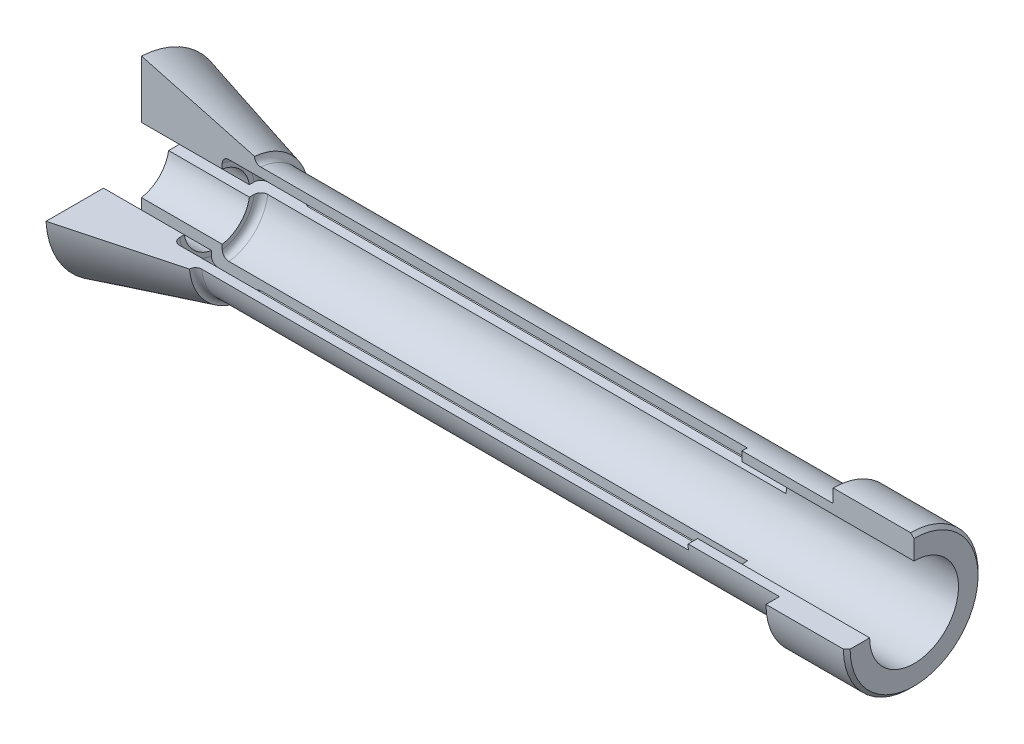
from build123d import *

# Parameters (mm, degrees)
CHANFREIN1_SIZE         = 0.25
ENL_V_MAT_EXTRU_1_DEPTH = 45
COUPE_DEPTH             = 59.549025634


with BuildPart() as part:
    # Esquisse1 → Base-R_volution (revolve)
    with BuildSketch(Plane.XY, mode=Mode.PRIVATE) as base_r_volution_sk:
        with BuildLine():
            Line((-3, 2.45), (-3, 6.7))
            Line((-3, 6.7), (5.4, 4.449226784))
            ThreePointArc((5.4, 4.449226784), (5.531575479, 4.131575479), (5.849226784, 4))
            Line((5.849226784, 4), (48.78, 4))
            Line((48.78, 4), (48.78, 5))
            Line((48.78, 5), (54.78, 5))
            Line((54.78, 5), (54.78, 3.3))
            Line((54.78, 3.3), (3.5, 3.3))
            ThreePointArc((3.5, 3.3), (3.146446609, 3.153553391), (3, 2.8))
            Line((3, 2.8), (3, 2.45))
            Line((3, 2.45), (-3, 2.45))
        make_face()
    revolve(base_r_volution_sk.sketch.rotate(Axis((-14.087394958, 0, 0), (1, 0, 0)), 90), axis=Axis((-14.087394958, 0, 0), (1, 0, 0)))

    # Chanfrein1
    chanfrein1_edges = [part.edges().sort_by_distance(p)[0] for p in [
        (54.78, 0, -5),
    ]]
    chamfer(chanfrein1_edges, length=CHANFREIN1_SIZE)

    # Esquisse2 → Enl_v. mat.-Extru.1 (cut)
    with BuildSketch(Plane.ZY.offset(3)):
        with BuildLine():
            Line((-0.4, 6.688049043), (-0.4, 2.417126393))
            ThreePointArc((-0.4, 2.417126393), (0, 2.45), (0.4, 2.417126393))
            Line((0.4, 2.417126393), (0.4, 6.688049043))
            ThreePointArc((0.4, 6.688049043), (0, 6.7), (-0.4, 6.688049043))
        make_face()
        with BuildLine():
            Line((-6.688049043, 0.4), (-2.417126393, 0.4))
            ThreePointArc((-2.417126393, 0.4), (-2.45, 0), (-2.417126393, -0.4))
            Line((-2.417126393, -0.4), (-6.688049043, -0.4))
            ThreePointArc((-6.688049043, -0.4), (-6.7, 0), (-6.688049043, 0.4))
        make_face()
        with BuildLine():
            Line((-0.4, -2.417126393), (-0.4, -6.688049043))
            ThreePointArc((-0.4, -6.688049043), (0, -6.7), (0.4, -6.688049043))
            Line((0.4, -6.688049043), (0.4, -2.417126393))
            ThreePointArc((0.4, -2.417126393), (0, -2.45), (-0.4, -2.417126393))
        make_face()
        with BuildLine():
            Line((2.417126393, 0.4), (6.688049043, 0.4))
            ThreePointArc((6.688049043, 0.4), (6.7, 0), (6.688049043, -0.4))
            Line((6.688049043, -0.4), (2.417126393, -0.4))
            ThreePointArc((2.417126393, -0.4), (2.45, 0), (2.417126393, 0.4))
        make_face()
    extrude(amount=-ENL_V_MAT_EXTRU_1_DEPTH, mode=Mode.SUBTRACT)

    # Esquisse3 → COUPE (cut, through all)
    with BuildSketch(Plane.ZY.offset(3)):
        with BuildLine():
            Line((0, 0), (0.0116937, 6.699989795))
            ThreePointArc((0.0116937, 6.699989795), (4.737615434, 4.737615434), (6.699989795, 0.0116937))
            Line((6.699989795, 0.0116937), (0, 0))
        make_face()
    extrude(amount=-COUPE_DEPTH, mode=Mode.SUBTRACT)


solid = part.part
